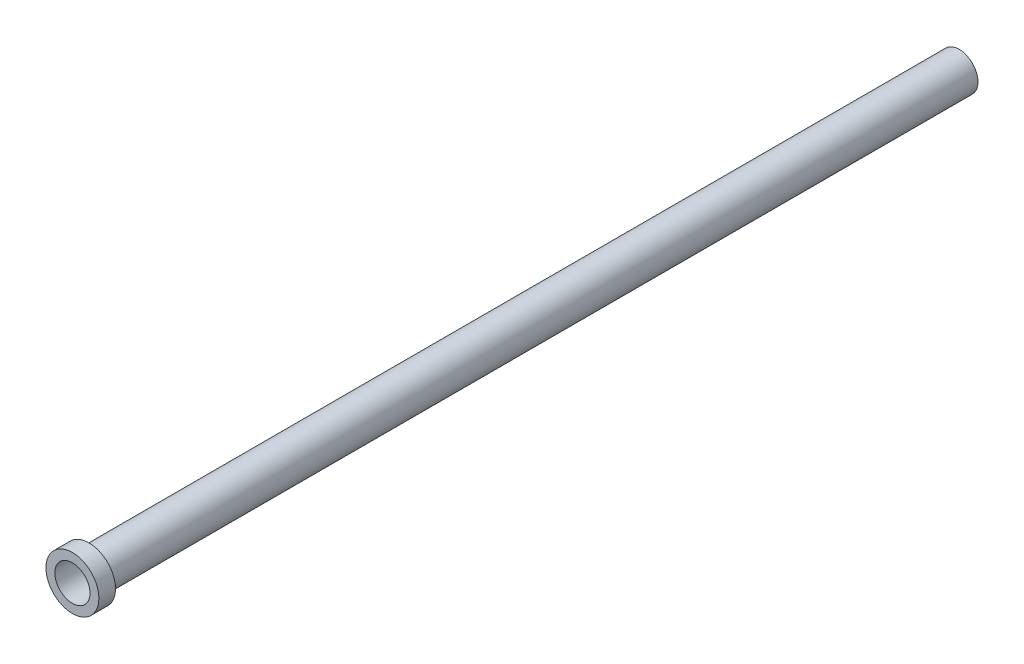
ISO-10303-21;
HEADER;
FILE_DESCRIPTION(('STEP AP214'),'2;1');
FILE_NAME('part.step','',(''),(''),'','','');
FILE_SCHEMA(('AUTOMOTIVE_DESIGN { 1 0 10303 214 1 1 1 1 }'));
ENDSEC;
DATA;
#1=APPLICATION_CONTEXT('core data for automotive mechanical design processes');
#2=APPLICATION_PROTOCOL_DEFINITION('international standard','automotive_design',2000,#1);
#3=PRODUCT_CONTEXT('',#1,'mechanical');
#4=PRODUCT('Part','Part','',(#3));
#5=PRODUCT_RELATED_PRODUCT_CATEGORY('part','',(#4));
#6=PRODUCT_DEFINITION_FORMATION('','',#4);
#7=PRODUCT_DEFINITION_CONTEXT('part definition',#1,'design');
#8=PRODUCT_DEFINITION('design','',#6,#7);
#9=PRODUCT_DEFINITION_SHAPE('','',#8);
#10=(LENGTH_UNIT() NAMED_UNIT(*) SI_UNIT(.MILLI.,.METRE.));
#11=(NAMED_UNIT(*) PLANE_ANGLE_UNIT() SI_UNIT($,.RADIAN.));
#12=(NAMED_UNIT(*) SI_UNIT($,.STERADIAN.) SOLID_ANGLE_UNIT());
#13=UNCERTAINTY_MEASURE_WITH_UNIT(LENGTH_MEASURE(1.E-05),#10,'distance_accuracy_value','');
#14=(GEOMETRIC_REPRESENTATION_CONTEXT(3) GLOBAL_UNCERTAINTY_ASSIGNED_CONTEXT((#13)) GLOBAL_UNIT_ASSIGNED_CONTEXT((#10,
#11,#12)) REPRESENTATION_CONTEXT('',''));
#15=CARTESIAN_POINT('',(0.,0.,0.));
#16=DIRECTION('',(0.,0.,1.));
#17=DIRECTION('',(1.,0.,0.));
#18=AXIS2_PLACEMENT_3D('',#15,#16,#17);
#19=CARTESIAN_POINT('',(0.,0.,1270.635));
#20=DIRECTION('',(0.,0.,-1.));
#21=DIRECTION('',(-1.,0.,0.));
#22=AXIS2_PLACEMENT_3D('',#19,#20,#21);
#23=CYLINDRICAL_SURFACE('',#22,26.9875);
#24=CARTESIAN_POINT('',(0.,0.,0.));
#25=DIRECTION('',(0.,0.,1.));
#26=DIRECTION('',(1.,0.,0.));
#27=AXIS2_PLACEMENT_3D('',#24,#25,#26);
#28=CIRCLE('',#27,26.9875);
#29=CARTESIAN_POINT('',(26.9875,0.,0.));
#30=VERTEX_POINT('',#29);
#31=EDGE_CURVE('E40',#30,#30,#28,.T.);
#32=ORIENTED_EDGE('',*,*,#31,.T.);
#33=EDGE_LOOP('',(#32));
#34=FACE_BOUND('',#33,.T.);
#35=CARTESIAN_POINT('',(0.,0.,1246.8225));
#36=DIRECTION('',(0.,0.,1.));
#37=DIRECTION('',(1.,0.,0.));
#38=AXIS2_PLACEMENT_3D('',#35,#36,#37);
#39=CIRCLE('',#38,26.9875);
#40=CARTESIAN_POINT('',(26.9875,0.,1246.8225));
#41=VERTEX_POINT('',#40);
#42=EDGE_CURVE('E10',#41,#41,#39,.T.);
#43=ORIENTED_EDGE('',*,*,#42,.F.);
#44=EDGE_LOOP('',(#43));
#45=FACE_BOUND('',#44,.T.);
#46=ADVANCED_FACE('F37',(#34,#45),#23,.T.);
#47=CARTESIAN_POINT('',(0.,0.,1270.635));
#48=DIRECTION('',(0.,0.,1.));
#49=DIRECTION('',(1.,0.,0.));
#50=AXIS2_PLACEMENT_3D('',#47,#48,#49);
#51=PLANE('',#50);
#52=CARTESIAN_POINT('',(0.,0.,1270.635));
#53=DIRECTION('',(0.,0.,1.));
#54=DIRECTION('',(1.,0.,0.));
#55=AXIS2_PLACEMENT_3D('',#52,#53,#54);
#56=CIRCLE('',#55,25.2095);
#57=CARTESIAN_POINT('',(25.2095,0.,1270.635));
#58=VERTEX_POINT('',#57);
#59=EDGE_CURVE('E50',#58,#58,#56,.T.);
#60=ORIENTED_EDGE('',*,*,#59,.F.);
#61=EDGE_LOOP('',(#60));
#62=FACE_BOUND('',#61,.T.);
#63=CARTESIAN_POINT('',(0.,0.,1270.635));
#64=DIRECTION('',(0.,0.,1.));
#65=DIRECTION('',(1.,0.,0.));
#66=AXIS2_PLACEMENT_3D('',#63,#64,#65);
#67=CIRCLE('',#66,37.9095);
#68=CARTESIAN_POINT('',(37.9095,0.,1270.635));
#69=VERTEX_POINT('',#68);
#70=EDGE_CURVE('E53',#69,#69,#67,.T.);
#71=ORIENTED_EDGE('',*,*,#70,.T.);
#72=EDGE_LOOP('',(#71));
#73=FACE_BOUND('',#72,.T.);
#74=ADVANCED_FACE('F71',(#62,#73),#51,.T.);
#75=CARTESIAN_POINT('',(0.,0.,0.));
#76=DIRECTION('',(0.,0.,1.));
#77=DIRECTION('',(1.,0.,0.));
#78=AXIS2_PLACEMENT_3D('',#75,#76,#77);
#79=PLANE('',#78);
#80=ORIENTED_EDGE('',*,*,#31,.F.);
#81=EDGE_LOOP('',(#80));
#82=FACE_BOUND('',#81,.T.);
#83=CARTESIAN_POINT('',(0.,0.,0.));
#84=DIRECTION('',(0.,0.,1.));
#85=DIRECTION('',(1.,0.,0.));
#86=AXIS2_PLACEMENT_3D('',#83,#84,#85);
#87=CIRCLE('',#86,25.2095);
#88=CARTESIAN_POINT('',(25.2095,0.,0.));
#89=VERTEX_POINT('',#88);
#90=EDGE_CURVE('E57',#89,#89,#87,.T.);
#91=ORIENTED_EDGE('',*,*,#90,.T.);
#92=EDGE_LOOP('',(#91));
#93=FACE_BOUND('',#92,.T.);
#94=ADVANCED_FACE('F89',(#82,#93),#79,.F.);
#95=CARTESIAN_POINT('',(0.,0.,1270.635));
#96=DIRECTION('',(0.,0.,-1.));
#97=DIRECTION('',(-1.,0.,0.));
#98=AXIS2_PLACEMENT_3D('',#95,#96,#97);
#99=CYLINDRICAL_SURFACE('',#98,25.2095);
#100=ORIENTED_EDGE('',*,*,#59,.T.);
#101=EDGE_LOOP('',(#100));
#102=FACE_BOUND('',#101,.T.);
#103=ORIENTED_EDGE('',*,*,#90,.F.);
#104=EDGE_LOOP('',(#103));
#105=FACE_BOUND('',#104,.T.);
#106=ADVANCED_FACE('F80',(#102,#105),#99,.F.);
#107=CARTESIAN_POINT('',(0.,0.,1246.8225));
#108=DIRECTION('',(0.,0.,1.));
#109=DIRECTION('',(1.,0.,0.));
#110=AXIS2_PLACEMENT_3D('',#107,#108,#109);
#111=PLANE('',#110);
#112=CARTESIAN_POINT('',(0.,0.,1246.8225));
#113=DIRECTION('',(0.,0.,1.));
#114=DIRECTION('',(1.,0.,0.));
#115=AXIS2_PLACEMENT_3D('',#112,#113,#114);
#116=CIRCLE('',#115,37.9095);
#117=CARTESIAN_POINT('',(37.9095,0.,1246.8225));
#118=VERTEX_POINT('',#117);
#119=EDGE_CURVE('E60',#118,#118,#116,.T.);
#120=ORIENTED_EDGE('',*,*,#119,.F.);
#121=EDGE_LOOP('',(#120));
#122=FACE_BOUND('',#121,.T.);
#123=ORIENTED_EDGE('',*,*,#42,.T.);
#124=EDGE_LOOP('',(#123));
#125=FACE_BOUND('',#124,.T.);
#126=ADVANCED_FACE('F75',(#122,#125),#111,.F.);
#127=CARTESIAN_POINT('',(0.,0.,1246.8225));
#128=DIRECTION('',(0.,0.,1.));
#129=DIRECTION('',(1.,0.,0.));
#130=AXIS2_PLACEMENT_3D('',#127,#128,#129);
#131=CYLINDRICAL_SURFACE('',#130,37.9095);
#132=ORIENTED_EDGE('',*,*,#119,.T.);
#133=EDGE_LOOP('',(#132));
#134=FACE_BOUND('',#133,.T.);
#135=ORIENTED_EDGE('',*,*,#70,.F.);
#136=EDGE_LOOP('',(#135));
#137=FACE_BOUND('',#136,.T.);
#138=ADVANCED_FACE('F73',(#134,#137),#131,.T.);
#139=CLOSED_SHELL('',(#46,#74,#94,#106,#126,#138));
#140=MANIFOLD_SOLID_BREP('B2',#139);
#141=ADVANCED_BREP_SHAPE_REPRESENTATION('',(#18,#140),#14);
#142=SHAPE_DEFINITION_REPRESENTATION(#9,#141);
ENDSEC;
END-ISO-10303-21;
